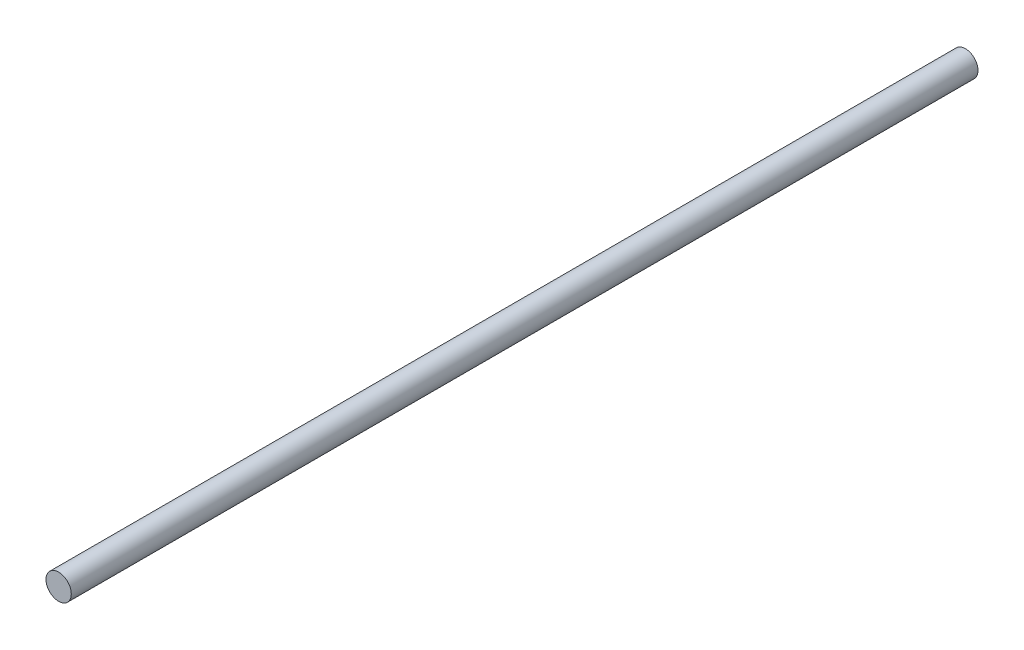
from build123d import *

# Parameters (mm, degrees)
SKETCH1_R           = 30
BOSS_EXTRUDE1_DEPTH = 2150


with BuildPart() as part:
    # Sketch1 → Boss-Extrude1 (new body)
    with BuildSketch(Plane.XY):
        Circle(SKETCH1_R)
    extrude(amount=-BOSS_EXTRUDE1_DEPTH)


solid = part.part
